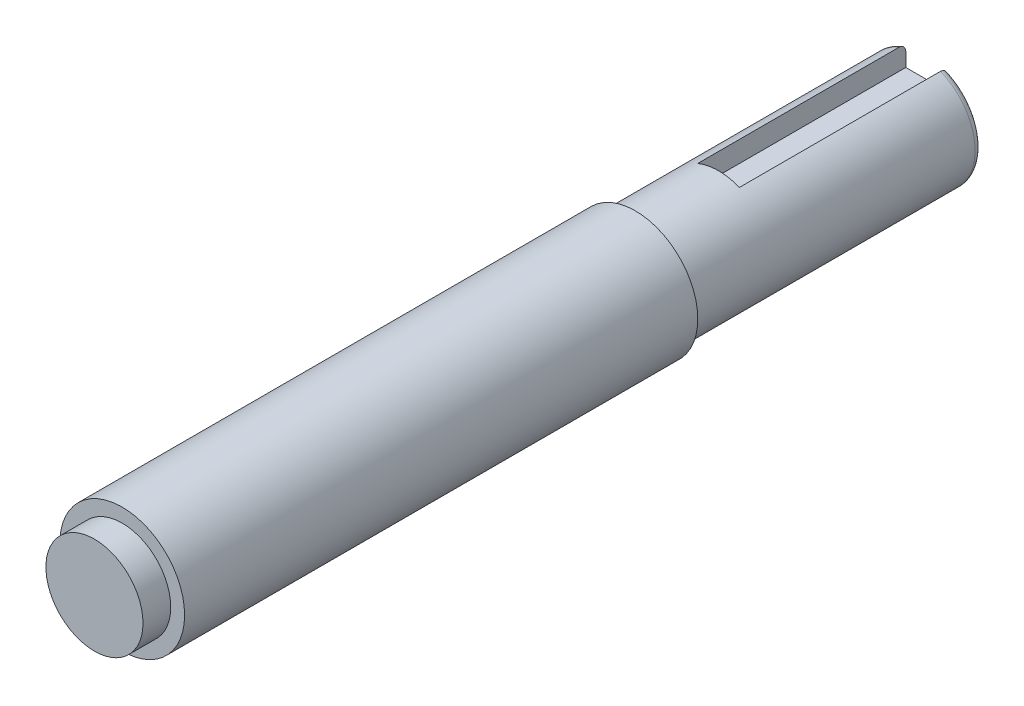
from build123d import *

# Parameters (mm, degrees)
SKETCH_1_R          = 4
EXTRUDE_1_DEPTH     = 21
SKETCH_2_R          = 4.5
EXTRUDE_2_DEPTH     = 37
CUT_EXTRUDE_1_DEPTH = 15
SKETCH_5_R          = 3.5
EXTRUDE_3_DEPTH     = 2
FILLET_1_R          = 0.5


with BuildPart() as part:
    # Sketch 1 → Extrude 1 (new body)
    with BuildSketch(Plane.XY):
        with Locations(Location((0, 0, 0), (0, 0, 180))):
            Circle(SKETCH_1_R)
    extrude(amount=EXTRUDE_1_DEPTH)

    # Sketch 2 → Extrude 2 (add)
    with BuildSketch(Plane.XY.offset(21)):
        Circle(SKETCH_2_R)
    extrude(amount=EXTRUDE_2_DEPTH)

    # Sketch 4 → Cut-Extrude 1 (cut)
    with BuildSketch(Plane(origin=(0, 0, 0), x_dir=(-1, 0, 0), z_dir=(0, 0, -1))):
        with BuildLine():
            Line((-1.5, 2.2), (0, 2.2))
            Line((0, 2.2), (1.5, 2.2))
            Line((1.5, 2.2), (1.5, 3.708099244))
            ThreePointArc((1.5, 3.708099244), (0, 4), (-1.5, 3.708099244))
            Line((-1.5, 3.708099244), (-1.5, 2.2))
        make_face()
    extrude(amount=-CUT_EXTRUDE_1_DEPTH, mode=Mode.SUBTRACT)

    # Sketch 5 → Extrude 3 (add)
    with BuildSketch(Plane.XY.offset(58)):
        Circle(SKETCH_5_R)
    extrude(amount=EXTRUDE_3_DEPTH)

    # Fillet 1
    fillet_1_edges = [part.edges().sort_by_distance(p)[0] for p in [
        (2.236067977, -3.31662479, 0),
    ]]
    fillet(fillet_1_edges, radius=FILLET_1_R)


solid = part.part
